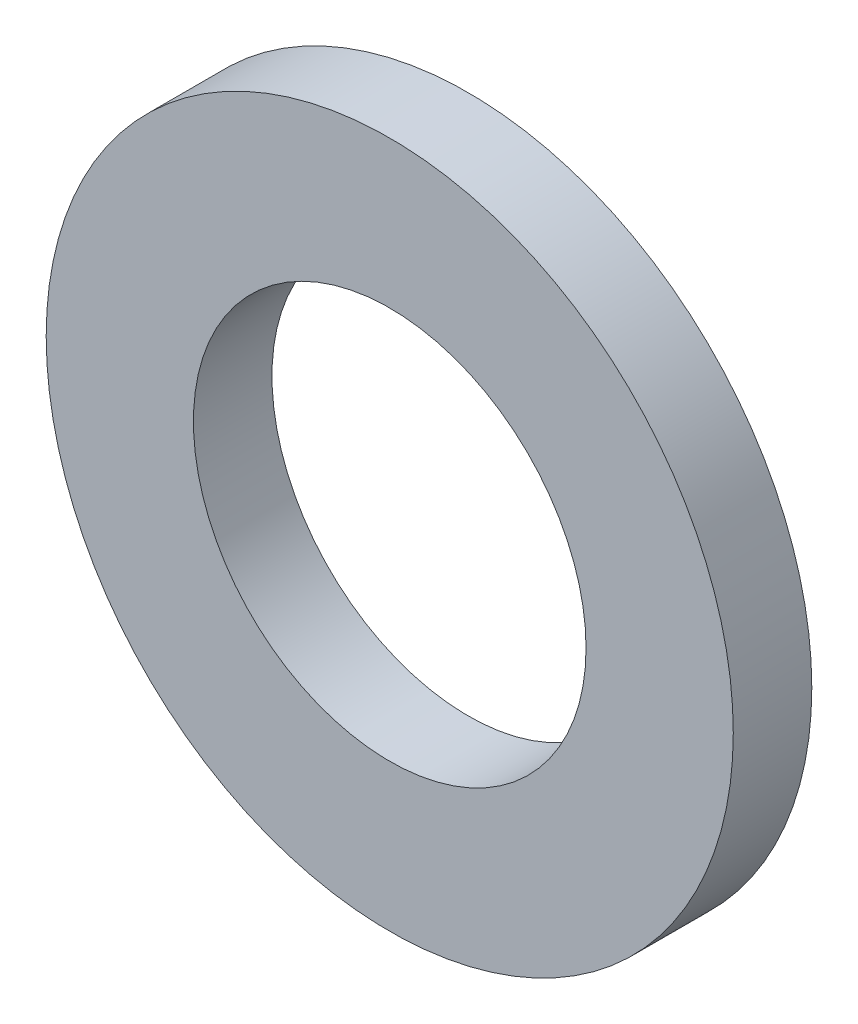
ISO-10303-21;
HEADER;
FILE_DESCRIPTION(('STEP AP214'),'2;1');
FILE_NAME('part.step','',(''),(''),'','','');
FILE_SCHEMA(('AUTOMOTIVE_DESIGN { 1 0 10303 214 1 1 1 1 }'));
ENDSEC;
DATA;
#1=APPLICATION_CONTEXT('core data for automotive mechanical design processes');
#2=APPLICATION_PROTOCOL_DEFINITION('international standard','automotive_design',2000,#1);
#3=PRODUCT_CONTEXT('',#1,'mechanical');
#4=PRODUCT('Part','Part','',(#3));
#5=PRODUCT_RELATED_PRODUCT_CATEGORY('part','',(#4));
#6=PRODUCT_DEFINITION_FORMATION('','',#4);
#7=PRODUCT_DEFINITION_CONTEXT('part definition',#1,'design');
#8=PRODUCT_DEFINITION('design','',#6,#7);
#9=PRODUCT_DEFINITION_SHAPE('','',#8);
#10=(LENGTH_UNIT() NAMED_UNIT(*) SI_UNIT(.MILLI.,.METRE.));
#11=(NAMED_UNIT(*) PLANE_ANGLE_UNIT() SI_UNIT($,.RADIAN.));
#12=(NAMED_UNIT(*) SI_UNIT($,.STERADIAN.) SOLID_ANGLE_UNIT());
#13=UNCERTAINTY_MEASURE_WITH_UNIT(LENGTH_MEASURE(1.E-05),#10,'distance_accuracy_value','');
#14=(GEOMETRIC_REPRESENTATION_CONTEXT(3) GLOBAL_UNCERTAINTY_ASSIGNED_CONTEXT((#13)) GLOBAL_UNIT_ASSIGNED_CONTEXT((#10,
#11,#12)) REPRESENTATION_CONTEXT('',''));
#15=CARTESIAN_POINT('',(0.,0.,0.));
#16=DIRECTION('',(0.,0.,1.));
#17=DIRECTION('',(1.,0.,0.));
#18=AXIS2_PLACEMENT_3D('',#15,#16,#17);
#19=CARTESIAN_POINT('',(0.,0.,4.));
#20=DIRECTION('',(0.,0.,1.));
#21=DIRECTION('',(1.,0.,0.));
#22=AXIS2_PLACEMENT_3D('',#19,#20,#21);
#23=PLANE('',#22);
#24=CARTESIAN_POINT('',(0.,0.,4.));
#25=DIRECTION('',(0.,0.,1.));
#26=DIRECTION('',(1.,0.,0.));
#27=AXIS2_PLACEMENT_3D('',#24,#25,#26);
#28=CIRCLE('',#27,17.5);
#29=CARTESIAN_POINT('',(17.5,0.,4.));
#30=VERTEX_POINT('',#29);
#31=EDGE_CURVE('E10',#30,#30,#28,.T.);
#32=ORIENTED_EDGE('',*,*,#31,.T.);
#33=EDGE_LOOP('',(#32));
#34=FACE_BOUND('',#33,.T.);
#35=CARTESIAN_POINT('',(0.,0.,4.));
#36=DIRECTION('',(0.,0.,1.));
#37=DIRECTION('',(1.,0.,0.));
#38=AXIS2_PLACEMENT_3D('',#35,#36,#37);
#39=CIRCLE('',#38,10.);
#40=CARTESIAN_POINT('',(10.,0.,4.));
#41=VERTEX_POINT('',#40);
#42=EDGE_CURVE('E39',#41,#41,#39,.T.);
#43=ORIENTED_EDGE('',*,*,#42,.F.);
#44=EDGE_LOOP('',(#43));
#45=FACE_BOUND('',#44,.T.);
#46=ADVANCED_FACE('F28',(#34,#45),#23,.T.);
#47=CARTESIAN_POINT('',(0.,0.,0.));
#48=DIRECTION('',(0.,0.,1.));
#49=DIRECTION('',(1.,0.,0.));
#50=AXIS2_PLACEMENT_3D('',#47,#48,#49);
#51=PLANE('',#50);
#52=CARTESIAN_POINT('',(0.,0.,0.));
#53=DIRECTION('',(0.,0.,1.));
#54=DIRECTION('',(1.,0.,0.));
#55=AXIS2_PLACEMENT_3D('',#52,#53,#54);
#56=CIRCLE('',#55,17.5);
#57=CARTESIAN_POINT('',(17.5,0.,0.));
#58=VERTEX_POINT('',#57);
#59=EDGE_CURVE('E35',#58,#58,#56,.T.);
#60=ORIENTED_EDGE('',*,*,#59,.F.);
#61=EDGE_LOOP('',(#60));
#62=FACE_BOUND('',#61,.T.);
#63=CARTESIAN_POINT('',(0.,0.,0.));
#64=DIRECTION('',(0.,0.,1.));
#65=DIRECTION('',(1.,0.,0.));
#66=AXIS2_PLACEMENT_3D('',#63,#64,#65);
#67=CIRCLE('',#66,10.);
#68=CARTESIAN_POINT('',(10.,0.,0.));
#69=VERTEX_POINT('',#68);
#70=EDGE_CURVE('E43',#69,#69,#67,.T.);
#71=ORIENTED_EDGE('',*,*,#70,.T.);
#72=EDGE_LOOP('',(#71));
#73=FACE_BOUND('',#72,.T.);
#74=ADVANCED_FACE('F49',(#62,#73),#51,.F.);
#75=CARTESIAN_POINT('',(0.,0.,4.));
#76=DIRECTION('',(0.,0.,-1.));
#77=DIRECTION('',(-1.,0.,0.));
#78=AXIS2_PLACEMENT_3D('',#75,#76,#77);
#79=CYLINDRICAL_SURFACE('',#78,17.5);
#80=ORIENTED_EDGE('',*,*,#31,.F.);
#81=EDGE_LOOP('',(#80));
#82=FACE_BOUND('',#81,.T.);
#83=ORIENTED_EDGE('',*,*,#59,.T.);
#84=EDGE_LOOP('',(#83));
#85=FACE_BOUND('',#84,.T.);
#86=ADVANCED_FACE('F30',(#82,#85),#79,.T.);
#87=CARTESIAN_POINT('',(0.,0.,4.));
#88=DIRECTION('',(0.,0.,-1.));
#89=DIRECTION('',(-1.,0.,0.));
#90=AXIS2_PLACEMENT_3D('',#87,#88,#89);
#91=CYLINDRICAL_SURFACE('',#90,10.);
#92=ORIENTED_EDGE('',*,*,#42,.T.);
#93=EDGE_LOOP('',(#92));
#94=FACE_BOUND('',#93,.T.);
#95=ORIENTED_EDGE('',*,*,#70,.F.);
#96=EDGE_LOOP('',(#95));
#97=FACE_BOUND('',#96,.T.);
#98=ADVANCED_FACE('F51',(#94,#97),#91,.F.);
#99=CLOSED_SHELL('',(#46,#74,#86,#98));
#100=MANIFOLD_SOLID_BREP('B2',#99);
#101=ADVANCED_BREP_SHAPE_REPRESENTATION('',(#18,#100),#14);
#102=SHAPE_DEFINITION_REPRESENTATION(#9,#101);
ENDSEC;
END-ISO-10303-21;
